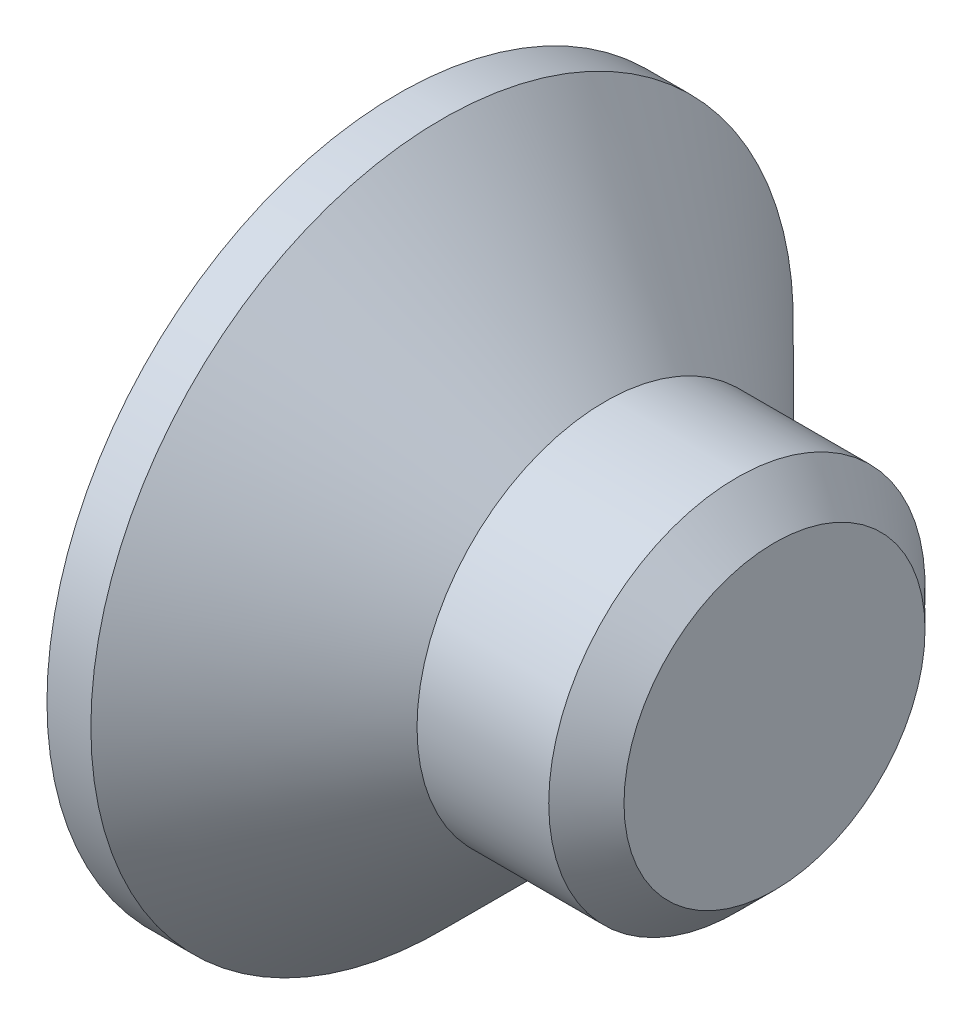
from build123d import *

# Parameters (mm, degrees)
CHAMFER1_SIZE      = 0.3
CUT_EXTRUDE1_DEPTH = 1.25


with BuildPart() as part:
    # Sketch1 → Revolve1 (revolve)
    with BuildSketch(Plane.XY, mode=Mode.PRIVATE) as revolve1_sk:
        Polygon((-1.65, 2.8), (-1.65, 0), (1.35, 0), (1.35, 1.5), (0, 1.5), (-1.3, 2.8), align=None)
    revolve(revolve1_sk.sketch.rotate(Axis((-1.65, 0, 0), (1, 0, 0)), 90), axis=Axis((-1.65, 0, 0), (1, 0, 0)))

    # Chamfer1
    chamfer1_edges = [part.edges().sort_by_distance(p)[0] for p in [
        (1.35, 0, -1.5),
    ]]
    chamfer(chamfer1_edges, length=CHAMFER1_SIZE)

    # Sketch2 → Cut-Extrude1 (cut)
    with BuildSketch(Plane.ZY.offset(1.65)):
        Polygon((-0.365, 1.45), (0.365, 1.45), (0.365, 0.365), (1.45, 0.365), (1.45, -0.365), (0.365, -0.365), (0.365, -1.45), (-0.365, -1.45), (-0.365, -0.365), (-1.45, -0.365), (-1.45, 0.365), (-0.365, 0.365), align=None)
    extrude(amount=-CUT_EXTRUDE1_DEPTH, mode=Mode.SUBTRACT)


solid = part.part
